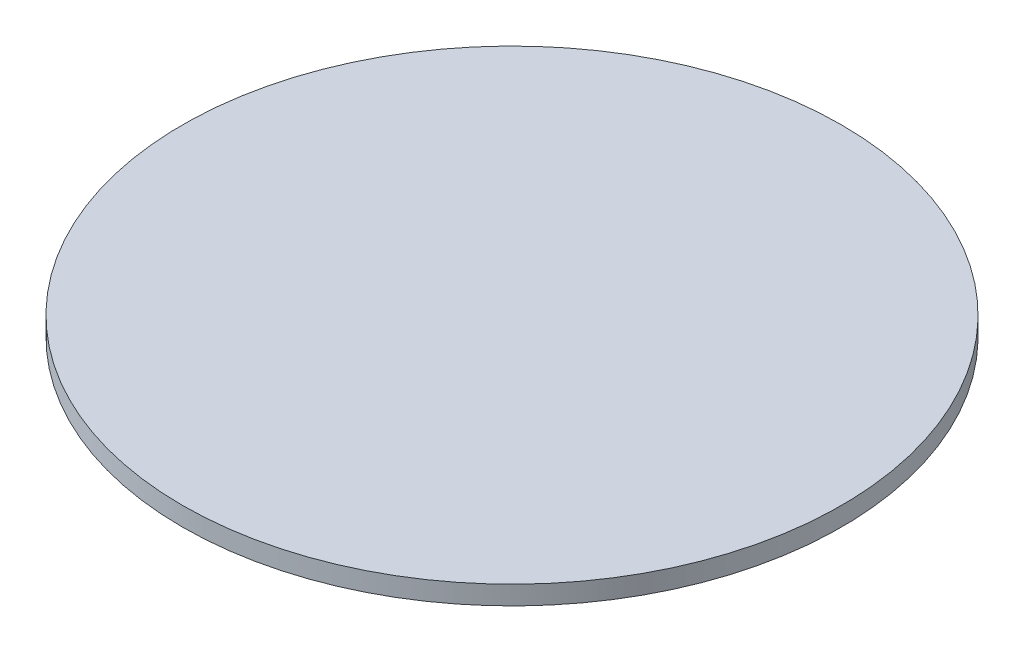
ISO-10303-21;
HEADER;
FILE_DESCRIPTION(('STEP AP214'),'2;1');
FILE_NAME('part.step','',(''),(''),'','','');
FILE_SCHEMA(('AUTOMOTIVE_DESIGN { 1 0 10303 214 1 1 1 1 }'));
ENDSEC;
DATA;
#1=APPLICATION_CONTEXT('core data for automotive mechanical design processes');
#2=APPLICATION_PROTOCOL_DEFINITION('international standard','automotive_design',2000,#1);
#3=PRODUCT_CONTEXT('',#1,'mechanical');
#4=PRODUCT('Part','Part','',(#3));
#5=PRODUCT_RELATED_PRODUCT_CATEGORY('part','',(#4));
#6=PRODUCT_DEFINITION_FORMATION('','',#4);
#7=PRODUCT_DEFINITION_CONTEXT('part definition',#1,'design');
#8=PRODUCT_DEFINITION('design','',#6,#7);
#9=PRODUCT_DEFINITION_SHAPE('','',#8);
#10=(LENGTH_UNIT() NAMED_UNIT(*) SI_UNIT(.MILLI.,.METRE.));
#11=(NAMED_UNIT(*) PLANE_ANGLE_UNIT() SI_UNIT($,.RADIAN.));
#12=(NAMED_UNIT(*) SI_UNIT($,.STERADIAN.) SOLID_ANGLE_UNIT());
#13=UNCERTAINTY_MEASURE_WITH_UNIT(LENGTH_MEASURE(1.E-05),#10,'distance_accuracy_value','');
#14=(GEOMETRIC_REPRESENTATION_CONTEXT(3) GLOBAL_UNCERTAINTY_ASSIGNED_CONTEXT((#13)) GLOBAL_UNIT_ASSIGNED_CONTEXT((#10,
#11,#12)) REPRESENTATION_CONTEXT('',''));
#15=CARTESIAN_POINT('',(0.,0.,0.));
#16=DIRECTION('',(0.,0.,1.));
#17=DIRECTION('',(1.,0.,0.));
#18=AXIS2_PLACEMENT_3D('',#15,#16,#17);
#19=CARTESIAN_POINT('',(0.,-2.54,0.));
#20=DIRECTION('',(0.,1.,0.));
#21=DIRECTION('',(0.,0.,1.));
#22=AXIS2_PLACEMENT_3D('',#19,#20,#21);
#23=PLANE('',#22);
#24=CARTESIAN_POINT('',(0.,-2.54,0.));
#25=DIRECTION('',(0.,1.,0.));
#26=DIRECTION('',(0.,0.,1.));
#27=AXIS2_PLACEMENT_3D('',#24,#25,#26);
#28=CIRCLE('',#27,44.45);
#29=CARTESIAN_POINT('',(0.,-2.54,44.45));
#30=VERTEX_POINT('',#29);
#31=EDGE_CURVE('E105',#30,#30,#28,.T.);
#32=ORIENTED_EDGE('',*,*,#31,.F.);
#33=EDGE_LOOP('',(#32));
#34=FACE_BOUND('',#33,.T.);
#35=CARTESIAN_POINT('',(18.3266247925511,-2.54,0.));
#36=DIRECTION('',(0.,-1.,0.));
#37=DIRECTION('',(0.,0.,-1.));
#38=AXIS2_PLACEMENT_3D('',#35,#36,#37);
#39=CIRCLE('',#38,15.875);
#40=CARTESIAN_POINT('',(18.3266247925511,-2.54,-15.875));
#41=VERTEX_POINT('',#40);
#42=CARTESIAN_POINT('',(34.2016247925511,-2.54,0.));
#43=VERTEX_POINT('',#42);
#44=EDGE_CURVE('E83',#41,#43,#39,.T.);
#45=ORIENTED_EDGE('',*,*,#44,.F.);
#46=DIRECTION('',(1.,0.,0.));
#47=VECTOR('',#46,1.);
#48=CARTESIAN_POINT('',(18.3266247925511,-2.54,-15.875));
#49=LINE('',#48,#47);
#50=CARTESIAN_POINT('',(-18.3377078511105,-2.54,-15.875));
#51=VERTEX_POINT('',#50);
#52=EDGE_CURVE('E86',#51,#41,#49,.T.);
#53=ORIENTED_EDGE('',*,*,#52,.F.);
#54=CARTESIAN_POINT('',(-18.3377078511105,-2.54,0.));
#55=DIRECTION('',(0.,-1.,0.));
#56=DIRECTION('',(0.,0.,1.));
#57=AXIS2_PLACEMENT_3D('',#54,#55,#56);
#58=CIRCLE('',#57,15.875);
#59=CARTESIAN_POINT('',(-34.2127078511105,-2.54,0.));
#60=VERTEX_POINT('',#59);
#61=EDGE_CURVE('E97',#60,#51,#58,.T.);
#62=ORIENTED_EDGE('',*,*,#61,.F.);
#63=DIRECTION('',(-1.,0.,0.));
#64=VECTOR('',#63,1.);
#65=CARTESIAN_POINT('',(34.2016247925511,-2.54,0.));
#66=LINE('',#65,#64);
#67=EDGE_CURVE('E88',#43,#60,#66,.T.);
#68=ORIENTED_EDGE('',*,*,#67,.F.);
#69=EDGE_LOOP('',(#45,#53,#62,#68));
#70=FACE_BOUND('',#69,.T.);
#71=ADVANCED_FACE('F39',(#34,#70),#23,.F.);
#72=CARTESIAN_POINT('',(0.,-2.54,0.));
#73=DIRECTION('',(0.,1.,0.));
#74=DIRECTION('',(0.,0.,1.));
#75=AXIS2_PLACEMENT_3D('',#72,#73,#74);
#76=CYLINDRICAL_SURFACE('',#75,44.45);
#77=ORIENTED_EDGE('',*,*,#31,.T.);
#78=EDGE_LOOP('',(#77));
#79=FACE_BOUND('',#78,.T.);
#80=CARTESIAN_POINT('',(0.,0.,0.));
#81=DIRECTION('',(0.,1.,0.));
#82=DIRECTION('',(0.,0.,1.));
#83=AXIS2_PLACEMENT_3D('',#80,#81,#82);
#84=CIRCLE('',#83,44.45);
#85=CARTESIAN_POINT('',(0.,0.,44.45));
#86=VERTEX_POINT('',#85);
#87=EDGE_CURVE('E100',#86,#86,#84,.T.);
#88=ORIENTED_EDGE('',*,*,#87,.F.);
#89=EDGE_LOOP('',(#88));
#90=FACE_BOUND('',#89,.T.);
#91=ADVANCED_FACE('F127',(#79,#90),#76,.T.);
#92=CARTESIAN_POINT('',(0.,0.,0.));
#93=DIRECTION('',(0.,1.,0.));
#94=DIRECTION('',(0.,0.,1.));
#95=AXIS2_PLACEMENT_3D('',#92,#93,#94);
#96=PLANE('',#95);
#97=ORIENTED_EDGE('',*,*,#87,.T.);
#98=EDGE_LOOP('',(#97));
#99=FACE_BOUND('',#98,.T.);
#100=ADVANCED_FACE('F133',(#99),#96,.T.);
#101=CARTESIAN_POINT('',(34.2016247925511,-8.89,0.));
#102=DIRECTION('',(0.,0.,-1.));
#103=DIRECTION('',(-1.,0.,0.));
#104=AXIS2_PLACEMENT_3D('',#101,#102,#103);
#105=PLANE('',#104);
#106=ORIENTED_EDGE('',*,*,#67,.T.);
#107=CARTESIAN_POINT('',(-23.391592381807,3.5052,0.));
#108=DIRECTION('',(0.,0.,-1.));
#109=DIRECTION('',(-1.,0.,0.));
#110=AXIS2_PLACEMENT_3D('',#107,#108,#109);
#111=CIRCLE('',#110,12.3952);
#112=CARTESIAN_POINT('',(-23.391592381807,-8.89,0.));
#113=VERTEX_POINT('',#112);
#114=EDGE_CURVE('E11',#60,#113,#111,.F.);
#115=ORIENTED_EDGE('',*,*,#114,.T.);
#116=DIRECTION('',(-1.,0.,0.));
#117=VECTOR('',#116,1.);
#118=CARTESIAN_POINT('',(34.2016247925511,-8.89,0.));
#119=LINE('',#118,#117);
#120=CARTESIAN_POINT('',(23.3805093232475,-8.89,0.));
#121=VERTEX_POINT('',#120);
#122=EDGE_CURVE('E96',#121,#113,#119,.T.);
#123=ORIENTED_EDGE('',*,*,#122,.F.);
#124=CARTESIAN_POINT('',(23.3805093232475,3.5052,0.));
#125=DIRECTION('',(0.,0.,-1.));
#126=DIRECTION('',(-1.,0.,0.));
#127=AXIS2_PLACEMENT_3D('',#124,#125,#126);
#128=CIRCLE('',#127,12.3952);
#129=EDGE_CURVE('E48',#121,#43,#128,.F.);
#130=ORIENTED_EDGE('',*,*,#129,.T.);
#131=EDGE_LOOP('',(#106,#115,#123,#130));
#132=FACE_BOUND('',#131,.T.);
#133=ADVANCED_FACE('F116',(#132),#105,.F.);
#134=CARTESIAN_POINT('',(18.3266247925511,-8.89,0.));
#135=DIRECTION('',(0.,-1.,0.));
#136=DIRECTION('',(0.,0.,-1.));
#137=AXIS2_PLACEMENT_3D('',#134,#135,#136);
#138=PLANE('',#137);
#139=ORIENTED_EDGE('',*,*,#122,.T.);
#140=CARTESIAN_POINT('',(-18.3377078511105,-8.89,0.));
#141=DIRECTION('',(0.,-1.,0.));
#142=DIRECTION('',(0.,0.,-1.));
#143=AXIS2_PLACEMENT_3D('',#140,#141,#142);
#144=CIRCLE('',#143,5.05388453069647);
#145=CARTESIAN_POINT('',(-18.3377078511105,-8.89,-5.05388453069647));
#146=VERTEX_POINT('',#145);
#147=EDGE_CURVE('E112',#113,#146,#144,.T.);
#148=ORIENTED_EDGE('',*,*,#147,.T.);
#149=DIRECTION('',(1.,0.,0.));
#150=VECTOR('',#149,1.);
#151=CARTESIAN_POINT('',(18.3266247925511,-8.89,-5.05388453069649));
#152=LINE('',#151,#150);
#153=CARTESIAN_POINT('',(18.3266247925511,-8.89,-5.05388453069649));
#154=VERTEX_POINT('',#153);
#155=EDGE_CURVE('E63',#146,#154,#152,.T.);
#156=ORIENTED_EDGE('',*,*,#155,.T.);
#157=CARTESIAN_POINT('',(18.3266247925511,-8.89,0.));
#158=DIRECTION('',(0.,-1.,0.));
#159=DIRECTION('',(0.,0.,-1.));
#160=AXIS2_PLACEMENT_3D('',#157,#158,#159);
#161=CIRCLE('',#160,5.05388453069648);
#162=EDGE_CURVE('E93',#154,#121,#161,.T.);
#163=ORIENTED_EDGE('',*,*,#162,.T.);
#164=EDGE_LOOP('',(#139,#148,#156,#163));
#165=FACE_BOUND('',#164,.T.);
#166=ADVANCED_FACE('F118',(#165),#138,.T.);
#167=CARTESIAN_POINT('',(18.3266247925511,3.5052,0.));
#168=DIRECTION('',(0.,1.,0.));
#169=DIRECTION('',(0.,0.,1.));
#170=AXIS2_PLACEMENT_3D('',#167,#168,#169);
#171=DEGENERATE_TOROIDAL_SURFACE('',#170,5.05388453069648,12.3952,.T.);
#172=ORIENTED_EDGE('',*,*,#129,.F.);
#173=ORIENTED_EDGE('',*,*,#162,.F.);
#174=CARTESIAN_POINT('',(18.3266247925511,3.5052,-5.05388453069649));
#175=DIRECTION('',(-1.,0.,0.));
#176=DIRECTION('',(0.,0.,1.));
#177=AXIS2_PLACEMENT_3D('',#174,#175,#176);
#178=CIRCLE('',#177,12.3952);
#179=EDGE_CURVE('E43',#41,#154,#178,.T.);
#180=ORIENTED_EDGE('',*,*,#179,.F.);
#181=ORIENTED_EDGE('',*,*,#44,.T.);
#182=EDGE_LOOP('',(#172,#173,#180,#181));
#183=FACE_BOUND('',#182,.T.);
#184=ADVANCED_FACE('F41',(#183),#171,.T.);
#185=CARTESIAN_POINT('',(18.3266247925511,3.5052,-5.05388453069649));
#186=DIRECTION('',(-1.,0.,0.));
#187=DIRECTION('',(0.,0.,1.));
#188=AXIS2_PLACEMENT_3D('',#185,#186,#187);
#189=CYLINDRICAL_SURFACE('',#188,12.3952);
#190=ORIENTED_EDGE('',*,*,#179,.T.);
#191=ORIENTED_EDGE('',*,*,#155,.F.);
#192=CARTESIAN_POINT('',(-18.3377078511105,3.5052,-5.05388453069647));
#193=DIRECTION('',(-1.,0.,0.));
#194=DIRECTION('',(0.,0.,1.));
#195=AXIS2_PLACEMENT_3D('',#192,#193,#194);
#196=CIRCLE('',#195,12.3952);
#197=EDGE_CURVE('E56',#51,#146,#196,.T.);
#198=ORIENTED_EDGE('',*,*,#197,.F.);
#199=ORIENTED_EDGE('',*,*,#52,.T.);
#200=EDGE_LOOP('',(#190,#191,#198,#199));
#201=FACE_BOUND('',#200,.T.);
#202=ADVANCED_FACE('F95',(#201),#189,.T.);
#203=CARTESIAN_POINT('',(-18.3377078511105,3.5052,0.));
#204=DIRECTION('',(0.,1.,0.));
#205=DIRECTION('',(0.,0.,1.));
#206=AXIS2_PLACEMENT_3D('',#203,#204,#205);
#207=DEGENERATE_TOROIDAL_SURFACE('',#206,5.05388453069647,12.3952,.T.);
#208=ORIENTED_EDGE('',*,*,#114,.F.);
#209=ORIENTED_EDGE('',*,*,#61,.T.);
#210=ORIENTED_EDGE('',*,*,#197,.T.);
#211=ORIENTED_EDGE('',*,*,#147,.F.);
#212=EDGE_LOOP('',(#208,#209,#210,#211));
#213=FACE_BOUND('',#212,.T.);
#214=ADVANCED_FACE('F119',(#213),#207,.T.);
#215=CLOSED_SHELL('',(#71,#91,#100,#133,#166,#184,#202,#214));
#216=MANIFOLD_SOLID_BREP('B2',#215);
#217=ADVANCED_BREP_SHAPE_REPRESENTATION('',(#18,#216),#14);
#218=SHAPE_DEFINITION_REPRESENTATION(#9,#217);
ENDSEC;
END-ISO-10303-21;
